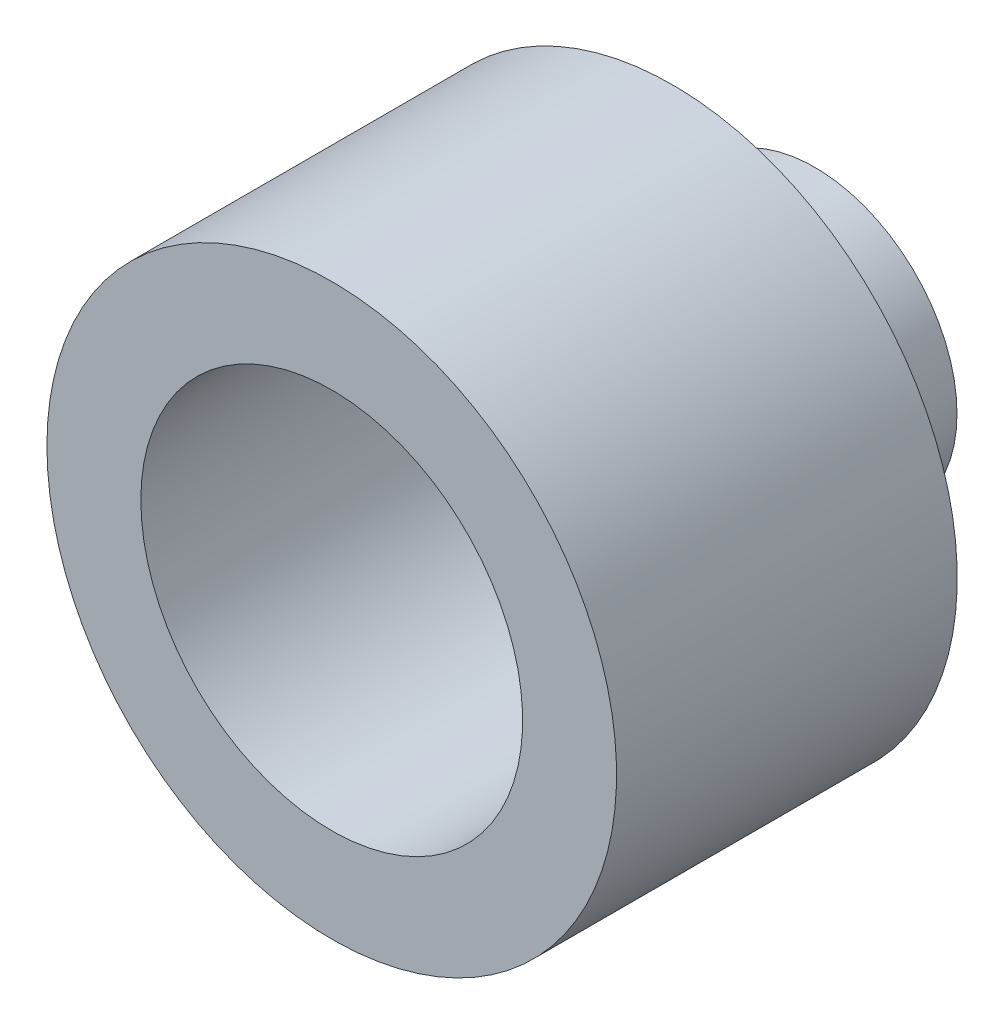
ISO-10303-21;
HEADER;
FILE_DESCRIPTION(('STEP AP214'),'2;1');
FILE_NAME('part.step','',(''),(''),'','','');
FILE_SCHEMA(('AUTOMOTIVE_DESIGN { 1 0 10303 214 1 1 1 1 }'));
ENDSEC;
DATA;
#1=APPLICATION_CONTEXT('core data for automotive mechanical design processes');
#2=APPLICATION_PROTOCOL_DEFINITION('international standard','automotive_design',2000,#1);
#3=PRODUCT_CONTEXT('',#1,'mechanical');
#4=PRODUCT('Part','Part','',(#3));
#5=PRODUCT_RELATED_PRODUCT_CATEGORY('part','',(#4));
#6=PRODUCT_DEFINITION_FORMATION('','',#4);
#7=PRODUCT_DEFINITION_CONTEXT('part definition',#1,'design');
#8=PRODUCT_DEFINITION('design','',#6,#7);
#9=PRODUCT_DEFINITION_SHAPE('','',#8);
#10=(LENGTH_UNIT() NAMED_UNIT(*) SI_UNIT(.MILLI.,.METRE.));
#11=(NAMED_UNIT(*) PLANE_ANGLE_UNIT() SI_UNIT($,.RADIAN.));
#12=(NAMED_UNIT(*) SI_UNIT($,.STERADIAN.) SOLID_ANGLE_UNIT());
#13=UNCERTAINTY_MEASURE_WITH_UNIT(LENGTH_MEASURE(1.E-05),#10,'distance_accuracy_value','');
#14=(GEOMETRIC_REPRESENTATION_CONTEXT(3) GLOBAL_UNCERTAINTY_ASSIGNED_CONTEXT((#13)) GLOBAL_UNIT_ASSIGNED_CONTEXT((#10,
#11,#12)) REPRESENTATION_CONTEXT('',''));
#15=CARTESIAN_POINT('',(0.,0.,0.));
#16=DIRECTION('',(0.,0.,1.));
#17=DIRECTION('',(1.,0.,0.));
#18=AXIS2_PLACEMENT_3D('',#15,#16,#17);
#19=CARTESIAN_POINT('',(0.,0.,0.));
#20=DIRECTION('',(0.,0.,-1.));
#21=DIRECTION('',(-1.,0.,0.));
#22=AXIS2_PLACEMENT_3D('',#19,#20,#21);
#23=CYLINDRICAL_SURFACE('',#22,26.035);
#24=CARTESIAN_POINT('',(0.,0.,0.));
#25=DIRECTION('',(0.,0.,-1.));
#26=DIRECTION('',(-1.,0.,0.));
#27=AXIS2_PLACEMENT_3D('',#24,#25,#26);
#28=CIRCLE('',#27,26.035);
#29=CARTESIAN_POINT('',(-26.035,0.,0.));
#30=VERTEX_POINT('',#29);
#31=EDGE_CURVE('E95',#30,#30,#28,.T.);
#32=ORIENTED_EDGE('',*,*,#31,.T.);
#33=EDGE_LOOP('',(#32));
#34=FACE_BOUND('',#33,.T.);
#35=CARTESIAN_POINT('',(0.,0.,-31.1404));
#36=DIRECTION('',(0.,0.,-1.));
#37=DIRECTION('',(-1.,0.,0.));
#38=AXIS2_PLACEMENT_3D('',#35,#36,#37);
#39=CIRCLE('',#38,26.035);
#40=CARTESIAN_POINT('',(-26.035,0.,-31.1404));
#41=VERTEX_POINT('',#40);
#42=EDGE_CURVE('E107',#41,#41,#39,.T.);
#43=ORIENTED_EDGE('',*,*,#42,.F.);
#44=EDGE_LOOP('',(#43));
#45=FACE_BOUND('',#44,.T.);
#46=ADVANCED_FACE('F38',(#34,#45),#23,.T.);
#47=CARTESIAN_POINT('',(0.,26.035,-31.1404));
#48=DIRECTION('',(0.,0.,-1.));
#49=DIRECTION('',(-1.,0.,0.));
#50=AXIS2_PLACEMENT_3D('',#47,#48,#49);
#51=PLANE('',#50);
#52=CARTESIAN_POINT('',(0.,0.,-31.1404));
#53=DIRECTION('',(0.,0.,-1.));
#54=DIRECTION('',(-1.,0.,0.));
#55=AXIS2_PLACEMENT_3D('',#52,#53,#54);
#56=CIRCLE('',#55,15.0048);
#57=CARTESIAN_POINT('',(-15.0048,0.,-31.1404));
#58=VERTEX_POINT('',#57);
#59=EDGE_CURVE('E54',#58,#58,#56,.F.);
#60=ORIENTED_EDGE('',*,*,#59,.T.);
#61=EDGE_LOOP('',(#60));
#62=FACE_BOUND('',#61,.T.);
#63=ORIENTED_EDGE('',*,*,#42,.T.);
#64=EDGE_LOOP('',(#63));
#65=FACE_BOUND('',#64,.T.);
#66=ADVANCED_FACE('F125',(#62,#65),#51,.T.);
#67=CARTESIAN_POINT('',(0.,0.,0.));
#68=DIRECTION('',(0.,0.,-1.));
#69=DIRECTION('',(-1.,0.,0.));
#70=AXIS2_PLACEMENT_3D('',#67,#68,#69);
#71=CYLINDRICAL_SURFACE('',#70,13.0048);
#72=CARTESIAN_POINT('',(0.,13.0048,-36.7648));
#73=CARTESIAN_POINT('',(0.117141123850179,13.0047980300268,-36.7648047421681));
#74=CARTESIAN_POINT('',(0.234347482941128,13.0032007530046,-36.7746345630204));
#75=CARTESIAN_POINT('',(0.465476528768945,12.9969826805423,-36.8136798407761));
#76=CARTESIAN_POINT('',(0.579396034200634,12.9923590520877,-36.8429134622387));
#77=CARTESIAN_POINT('',(0.80057366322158,12.9806071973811,-36.9198636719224));
#78=CARTESIAN_POINT('',(0.90783702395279,12.973480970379,-36.9675655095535));
#79=CARTESIAN_POINT('',(1.11282271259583,12.9575087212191,-37.0800602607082));
#80=CARTESIAN_POINT('',(1.2105462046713,12.9486629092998,-37.1448510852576));
#81=CARTESIAN_POINT('',(1.39457202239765,12.9301440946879,-37.2903051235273));
#82=CARTESIAN_POINT('',(1.48077605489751,12.9204650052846,-37.371091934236));
#83=CARTESIAN_POINT('',(1.63846719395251,12.9014174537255,-37.5459786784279));
#84=CARTESIAN_POINT('',(1.70995339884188,12.8920490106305,-37.6400794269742));
#85=CARTESIAN_POINT('',(1.83656998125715,12.8746245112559,-37.8395933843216));
#86=CARTESIAN_POINT('',(1.89160382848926,12.8665763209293,-37.9450686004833));
#87=CARTESIAN_POINT('',(1.98313632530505,12.8527876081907,-38.163917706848));
#88=CARTESIAN_POINT('',(2.01963614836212,12.8470469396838,-38.2772910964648));
#89=CARTESIAN_POINT('',(2.07275621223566,12.8385836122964,-38.5076789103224));
#90=CARTESIAN_POINT('',(2.08954570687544,12.8358352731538,-38.6246533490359));
#91=CARTESIAN_POINT('',(2.10329315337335,12.8335900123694,-38.859788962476));
#92=CARTESIAN_POINT('',(2.10025242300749,12.8340928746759,-38.9779500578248));
#93=CARTESIAN_POINT('',(2.07456374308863,12.8382697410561,-39.2109006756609));
#94=CARTESIAN_POINT('',(2.0521053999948,12.8419130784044,-39.3257117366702));
#95=CARTESIAN_POINT('',(1.98851632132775,12.8519124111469,-39.5499144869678));
#96=CARTESIAN_POINT('',(1.94738498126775,12.8582684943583,-39.6593060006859));
#97=CARTESIAN_POINT('',(1.84742364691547,12.8730105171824,-39.8701350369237));
#98=CARTESIAN_POINT('',(1.78851441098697,12.8814055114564,-39.9715343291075));
#99=CARTESIAN_POINT('',(1.65472581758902,12.8992730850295,-40.1630805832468));
#100=CARTESIAN_POINT('',(1.57984524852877,12.9087457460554,-40.2532266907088));
#101=CARTESIAN_POINT('',(1.41520401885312,12.9278363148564,-40.4208056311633));
#102=CARTESIAN_POINT('',(1.32528056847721,12.9374546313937,-40.498078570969));
#103=CARTESIAN_POINT('',(1.13365810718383,12.9556508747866,-40.6364620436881));
#104=CARTESIAN_POINT('',(1.03195902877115,12.9642287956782,-40.6975724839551));
#105=CARTESIAN_POINT('',(0.819525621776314,12.9793888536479,-40.8019087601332));
#106=CARTESIAN_POINT('',(0.708784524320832,12.9859694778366,-40.8451210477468));
#107=CARTESIAN_POINT('',(0.481486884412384,12.9963811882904,-40.9122890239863));
#108=CARTESIAN_POINT('',(0.364930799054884,13.0002124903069,-40.9362462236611));
#109=CARTESIAN_POINT('',(0.130690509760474,13.0046650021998,-40.9640085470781));
#110=CARTESIAN_POINT('',(0.0130329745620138,13.0053211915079,-40.968033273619));
#111=CARTESIAN_POINT('',(-0.221275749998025,13.0034451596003,-40.9564010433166));
#112=CARTESIAN_POINT('',(-0.337926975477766,13.0009130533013,-40.9407447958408));
#113=CARTESIAN_POINT('',(-0.566237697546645,12.992966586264,-40.8903776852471));
#114=CARTESIAN_POINT('',(-0.677921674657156,12.987568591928,-40.8557749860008));
#115=CARTESIAN_POINT('',(-0.893903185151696,12.9744933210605,-40.7686121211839));
#116=CARTESIAN_POINT('',(-0.998200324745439,12.9668159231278,-40.7160509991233));
#117=CARTESIAN_POINT('',(-1.19740522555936,12.949947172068,-40.5939564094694));
#118=CARTESIAN_POINT('',(-1.29222744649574,12.9407437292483,-40.5242850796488));
#119=CARTESIAN_POINT('',(-1.46891250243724,12.9218817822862,-40.3701381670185));
#120=CARTESIAN_POINT('',(-1.55077445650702,12.9122232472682,-40.2856615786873));
#121=CARTESIAN_POINT('',(-1.70002443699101,12.8934272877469,-40.103319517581));
#122=CARTESIAN_POINT('',(-1.76726445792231,12.8842958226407,-40.0053321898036));
#123=CARTESIAN_POINT('',(-1.88432978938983,12.8676973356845,-39.7993243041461));
#124=CARTESIAN_POINT('',(-1.93415562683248,12.8602302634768,-39.6913040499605));
#125=CARTESIAN_POINT('',(-2.01475426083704,12.8478502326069,-39.4687192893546));
#126=CARTESIAN_POINT('',(-2.04560208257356,12.8429272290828,-39.3541825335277));
#127=CARTESIAN_POINT('',(-2.08760602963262,12.8361670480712,-39.1214675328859));
#128=CARTESIAN_POINT('',(-2.09876375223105,12.8343296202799,-39.0032895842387));
#129=CARTESIAN_POINT('',(-2.10102832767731,12.8339589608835,-38.7681238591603));
#130=CARTESIAN_POINT('',(-2.09236805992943,12.8353873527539,-38.6511383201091));
#131=CARTESIAN_POINT('',(-2.05574459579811,12.8413035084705,-38.4203117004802));
#132=CARTESIAN_POINT('',(-2.02778145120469,12.8457912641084,-38.3064706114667));
#133=CARTESIAN_POINT('',(-1.95343303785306,12.8573062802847,-38.0852462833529));
#134=CARTESIAN_POINT('',(-1.90706660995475,12.8643309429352,-37.9778565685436));
#135=CARTESIAN_POINT('',(-1.79725145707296,12.8801309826,-37.7723425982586));
#136=CARTESIAN_POINT('',(-1.73380197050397,12.8889064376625,-37.6742187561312));
#137=CARTESIAN_POINT('',(-1.59078581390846,12.9073415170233,-37.4888431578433));
#138=CARTESIAN_POINT('',(-1.51104743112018,12.917009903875,-37.4017247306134));
#139=CARTESIAN_POINT('',(-1.33807948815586,12.9360705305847,-37.2420243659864));
#140=CARTESIAN_POINT('',(-1.24484681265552,12.9454627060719,-37.1694457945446));
#141=CARTESIAN_POINT('',(-1.04682470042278,12.9629825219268,-37.0404607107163));
#142=CARTESIAN_POINT('',(-0.941964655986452,12.971101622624,-36.9841614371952));
#143=CARTESIAN_POINT('',(-0.724189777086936,12.9850772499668,-36.8900618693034));
#144=CARTESIAN_POINT('',(-0.611283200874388,12.9909360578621,-36.8522429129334));
#145=CARTESIAN_POINT('',(-0.414929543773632,12.9984333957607,-36.804506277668));
#146=CARTESIAN_POINT('',(-0.332678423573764,13.0008082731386,-36.7896399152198));
#147=CARTESIAN_POINT('',(-0.166962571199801,13.0039922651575,-36.7697851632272));
#148=CARTESIAN_POINT('',(-0.0834978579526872,13.0048014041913,-36.7647966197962));
#149=CARTESIAN_POINT('',(0.,13.0048,-36.7648));
#150=B_SPLINE_CURVE_WITH_KNOTS('',3,(#72,#73,#74,#75,#76,#77,#78,#79,#80,#81,#82,#83,#84,#85,
#86,#87,#88,#89,#90,#91,#92,#93,#94,#95,#96,#97,#98,#99,#100,#101,#102,#103,#104,#105,#106,#107,
#108,#109,#110,#111,#112,#113,#114,#115,#116,#117,#118,#119,#120,#121,#122,#123,#124,#125,#126,
#127,#128,#129,#130,#131,#132,#133,#134,#135,#136,#137,#138,#139,#140,#141,#142,#143,#144,#145,
#146,#147,#148,#149),.UNSPECIFIED.,.T.,.F.,(4,2,2,2,2,2,2,2,2,2,2,2,2,2,2,2,2,2,2,2,2,2,2,2,2,2,
2,2,2,2,2,2,2,2,2,2,2,2,4),(0.,0.35111819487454,0.70256554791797,1.05373277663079,
1.40485709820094,1.75880851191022,2.11278160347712,2.46879252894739,2.82478091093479,
3.17768950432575,3.53057464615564,3.88005240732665,4.22954148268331,4.58061194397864,
4.93170904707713,5.28688573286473,5.64206445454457,5.99751154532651,6.35293073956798,
6.70442531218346,7.05590721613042,7.40540314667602,7.75491769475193,8.10734651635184,
8.45979928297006,8.815668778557,9.17152750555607,9.52597023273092,9.88038420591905,
10.2306549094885,10.580924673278,10.9308367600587,11.28076444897,11.6345913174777,
11.98850000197,12.3446895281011,12.7005186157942,12.9507985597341,13.2010746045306),.UNSPECIFIED.);
#151=CARTESIAN_POINT('',(0.,13.0048,-36.7648));
#152=VERTEX_POINT('',#151);
#153=EDGE_CURVE('E10',#152,#152,#150,.T.);
#154=ORIENTED_EDGE('',*,*,#153,.F.);
#155=EDGE_LOOP('',(#154));
#156=FACE_BOUND('',#155,.T.);
#157=CARTESIAN_POINT('',(-13.0048,0.,-33.7648));
#158=CARTESIAN_POINT('',(-13.0047980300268,0.117141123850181,-33.7648047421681));
#159=CARTESIAN_POINT('',(-13.0032007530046,0.234347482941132,-33.7746345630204));
#160=CARTESIAN_POINT('',(-12.9969826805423,0.465476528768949,-33.813679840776));
#161=CARTESIAN_POINT('',(-12.9923590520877,0.579396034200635,-33.8429134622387));
#162=CARTESIAN_POINT('',(-12.9806071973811,0.800573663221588,-33.9198636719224));
#163=CARTESIAN_POINT('',(-12.973480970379,0.907837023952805,-33.9675655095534));
#164=CARTESIAN_POINT('',(-12.9575087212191,1.11282271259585,-34.0800602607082));
#165=CARTESIAN_POINT('',(-12.9486629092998,1.21054620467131,-34.1448510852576));
#166=CARTESIAN_POINT('',(-12.9301440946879,1.39457202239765,-34.2903051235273));
#167=CARTESIAN_POINT('',(-12.9204650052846,1.48077605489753,-34.3710919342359));
#168=CARTESIAN_POINT('',(-12.9014174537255,1.63846719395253,-34.5459786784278));
#169=CARTESIAN_POINT('',(-12.8920490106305,1.70995339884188,-34.6400794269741));
#170=CARTESIAN_POINT('',(-12.8746245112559,1.83656998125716,-34.8395933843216));
#171=CARTESIAN_POINT('',(-12.8665763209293,1.89160382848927,-34.9450686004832));
#172=CARTESIAN_POINT('',(-12.8527876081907,1.98313632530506,-35.163917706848));
#173=CARTESIAN_POINT('',(-12.8470469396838,2.01963614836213,-35.2772910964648));
#174=CARTESIAN_POINT('',(-12.8385836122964,2.07275621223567,-35.5076789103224));
#175=CARTESIAN_POINT('',(-12.8358352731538,2.08954570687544,-35.6246533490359));
#176=CARTESIAN_POINT('',(-12.8335900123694,2.10329315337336,-35.859788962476));
#177=CARTESIAN_POINT('',(-12.8340928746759,2.1002524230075,-35.9779500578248));
#178=CARTESIAN_POINT('',(-12.8382697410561,2.07456374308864,-36.2109006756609));
#179=CARTESIAN_POINT('',(-12.8419130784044,2.0521053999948,-36.3257117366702));
#180=CARTESIAN_POINT('',(-12.8519124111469,1.98851632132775,-36.5499144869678));
#181=CARTESIAN_POINT('',(-12.8582684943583,1.94738498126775,-36.6593060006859));
#182=CARTESIAN_POINT('',(-12.8730105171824,1.84742364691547,-36.8701350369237));
#183=CARTESIAN_POINT('',(-12.8814055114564,1.78851441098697,-36.9715343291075));
#184=CARTESIAN_POINT('',(-12.8992730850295,1.65472581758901,-37.1630805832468));
#185=CARTESIAN_POINT('',(-12.9087457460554,1.57984524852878,-37.2532266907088));
#186=CARTESIAN_POINT('',(-12.9278363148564,1.41520401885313,-37.4208056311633));
#187=CARTESIAN_POINT('',(-12.9374546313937,1.3252805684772,-37.498078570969));
#188=CARTESIAN_POINT('',(-12.9556508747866,1.13365810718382,-37.636462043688));
#189=CARTESIAN_POINT('',(-12.9642287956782,1.03195902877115,-37.6975724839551));
#190=CARTESIAN_POINT('',(-12.9793888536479,0.819525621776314,-37.8019087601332));
#191=CARTESIAN_POINT('',(-12.9859694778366,0.708784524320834,-37.8451210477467));
#192=CARTESIAN_POINT('',(-12.9963811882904,0.481486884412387,-37.9122890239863));
#193=CARTESIAN_POINT('',(-13.0002124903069,0.364930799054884,-37.9362462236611));
#194=CARTESIAN_POINT('',(-13.0046650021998,0.130690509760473,-37.9640085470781));
#195=CARTESIAN_POINT('',(-13.0053211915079,0.0130329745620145,-37.968033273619));
#196=CARTESIAN_POINT('',(-13.0034451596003,-0.221275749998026,-37.9564010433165));
#197=CARTESIAN_POINT('',(-13.0009130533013,-0.337926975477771,-37.9407447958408));
#198=CARTESIAN_POINT('',(-12.992966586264,-0.566237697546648,-37.8903776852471));
#199=CARTESIAN_POINT('',(-12.987568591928,-0.677921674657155,-37.8557749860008));
#200=CARTESIAN_POINT('',(-12.9744933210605,-0.893903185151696,-37.7686121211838));
#201=CARTESIAN_POINT('',(-12.9668159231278,-0.998200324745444,-37.7160509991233));
#202=CARTESIAN_POINT('',(-12.949947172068,-1.19740522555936,-37.5939564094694));
#203=CARTESIAN_POINT('',(-12.9407437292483,-1.29222744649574,-37.5242850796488));
#204=CARTESIAN_POINT('',(-12.9218817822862,-1.46891250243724,-37.3701381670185));
#205=CARTESIAN_POINT('',(-12.9122232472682,-1.55077445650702,-37.2856615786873));
#206=CARTESIAN_POINT('',(-12.8934272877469,-1.70002443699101,-37.103319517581));
#207=CARTESIAN_POINT('',(-12.8842958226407,-1.76726445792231,-37.0053321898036));
#208=CARTESIAN_POINT('',(-12.8676973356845,-1.88432978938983,-36.799324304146));
#209=CARTESIAN_POINT('',(-12.8602302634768,-1.93415562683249,-36.6913040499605));
#210=CARTESIAN_POINT('',(-12.8478502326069,-2.01475426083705,-36.4687192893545));
#211=CARTESIAN_POINT('',(-12.8429272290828,-2.04560208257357,-36.3541825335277));
#212=CARTESIAN_POINT('',(-12.8361670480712,-2.08760602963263,-36.1214675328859));
#213=CARTESIAN_POINT('',(-12.8343296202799,-2.09876375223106,-36.0032895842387));
#214=CARTESIAN_POINT('',(-12.8339589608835,-2.10102832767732,-35.7681238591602));
#215=CARTESIAN_POINT('',(-12.8353873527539,-2.09236805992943,-35.651138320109));
#216=CARTESIAN_POINT('',(-12.8413035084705,-2.05574459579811,-35.4203117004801));
#217=CARTESIAN_POINT('',(-12.8457912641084,-2.0277814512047,-35.3064706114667));
#218=CARTESIAN_POINT('',(-12.8573062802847,-1.95343303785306,-35.0852462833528));
#219=CARTESIAN_POINT('',(-12.8643309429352,-1.90706660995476,-34.9778565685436));
#220=CARTESIAN_POINT('',(-12.8801309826,-1.79725145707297,-34.7723425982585));
#221=CARTESIAN_POINT('',(-12.8889064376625,-1.73380197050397,-34.6742187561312));
#222=CARTESIAN_POINT('',(-12.9073415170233,-1.59078581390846,-34.4888431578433));
#223=CARTESIAN_POINT('',(-12.917009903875,-1.51104743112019,-34.4017247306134));
#224=CARTESIAN_POINT('',(-12.9360705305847,-1.33807948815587,-34.2420243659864));
#225=CARTESIAN_POINT('',(-12.9454627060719,-1.24484681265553,-34.1694457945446));
#226=CARTESIAN_POINT('',(-12.9629825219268,-1.04682470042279,-34.0404607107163));
#227=CARTESIAN_POINT('',(-12.971101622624,-0.941964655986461,-33.9841614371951));
#228=CARTESIAN_POINT('',(-12.9850772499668,-0.724189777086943,-33.8900618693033));
#229=CARTESIAN_POINT('',(-12.9909360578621,-0.61128320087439,-33.8522429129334));
#230=CARTESIAN_POINT('',(-12.9984333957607,-0.41492954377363,-33.8045062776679));
#231=CARTESIAN_POINT('',(-13.0008082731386,-0.332678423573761,-33.7896399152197));
#232=CARTESIAN_POINT('',(-13.0039922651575,-0.1669625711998,-33.7697851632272));
#233=CARTESIAN_POINT('',(-13.0048014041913,-0.0834978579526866,-33.7647966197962));
#234=CARTESIAN_POINT('',(-13.0048,0.,-33.7648));
#235=B_SPLINE_CURVE_WITH_KNOTS('',3,(#157,#158,#159,#160,#161,#162,#163,#164,#165,#166,#167,
#168,#169,#170,#171,#172,#173,#174,#175,#176,#177,#178,#179,#180,#181,#182,#183,#184,#185,#186,
#187,#188,#189,#190,#191,#192,#193,#194,#195,#196,#197,#198,#199,#200,#201,#202,#203,#204,#205,
#206,#207,#208,#209,#210,#211,#212,#213,#214,#215,#216,#217,#218,#219,#220,#221,#222,#223,#224,
#225,#226,#227,#228,#229,#230,#231,#232,#233,#234),.UNSPECIFIED.,.T.,.F.,(4,2,2,2,2,2,2,2,2,2,2,
2,2,2,2,2,2,2,2,2,2,2,2,2,2,2,2,2,2,2,2,2,2,2,2,2,2,2,4),(0.,0.351118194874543,
0.702565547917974,1.05373277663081,1.40485709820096,1.75880851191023,2.11278160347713,
2.46879252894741,2.82478091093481,3.17768950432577,3.53057464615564,3.88005240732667,
4.22954148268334,4.58061194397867,4.93170904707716,5.28688573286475,5.64206445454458,
5.99751154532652,6.352930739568,6.70442531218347,7.05590721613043,7.40540314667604,
7.75491769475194,8.10734651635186,8.45979928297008,8.81566877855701,9.17152750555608,
9.52597023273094,9.88038420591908,10.2306549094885,10.580924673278,10.9308367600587,
11.28076444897,11.6345913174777,11.98850000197,12.3446895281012,12.7005186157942,
12.9507985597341,13.2010746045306),.UNSPECIFIED.);
#236=CARTESIAN_POINT('',(-13.0048,0.,-33.7648));
#237=VERTEX_POINT('',#236);
#238=EDGE_CURVE('E50',#237,#237,#235,.T.);
#239=ORIENTED_EDGE('',*,*,#238,.F.);
#240=EDGE_LOOP('',(#239));
#241=FACE_BOUND('',#240,.T.);
#242=CARTESIAN_POINT('',(0.,0.,-33.1404));
#243=DIRECTION('',(0.,0.,-1.));
#244=DIRECTION('',(-1.,0.,0.));
#245=AXIS2_PLACEMENT_3D('',#242,#243,#244);
#246=CIRCLE('',#245,13.0048);
#247=CARTESIAN_POINT('',(-13.0048,0.,-33.1404));
#248=VERTEX_POINT('',#247);
#249=EDGE_CURVE('E58',#248,#248,#246,.T.);
#250=ORIENTED_EDGE('',*,*,#249,.T.);
#251=EDGE_LOOP('',(#250));
#252=FACE_BOUND('',#251,.T.);
#253=CARTESIAN_POINT('',(0.,0.,-44.1452));
#254=DIRECTION('',(0.,0.,-1.));
#255=DIRECTION('',(-1.,0.,0.));
#256=AXIS2_PLACEMENT_3D('',#253,#254,#255);
#257=CIRCLE('',#256,13.0048);
#258=CARTESIAN_POINT('',(-13.0048,0.,-44.1452));
#259=VERTEX_POINT('',#258);
#260=EDGE_CURVE('E104',#259,#259,#257,.T.);
#261=ORIENTED_EDGE('',*,*,#260,.F.);
#262=EDGE_LOOP('',(#261));
#263=FACE_BOUND('',#262,.T.);
#264=ADVANCED_FACE('F65',(#156,#241,#252,#263),#71,.T.);
#265=CARTESIAN_POINT('',(0.,13.0048,-44.1452));
#266=DIRECTION('',(0.,0.,-1.));
#267=DIRECTION('',(-1.,0.,0.));
#268=AXIS2_PLACEMENT_3D('',#265,#266,#267);
#269=PLANE('',#268);
#270=CARTESIAN_POINT('',(0.,0.,-44.1452));
#271=DIRECTION('',(0.,0.,-1.));
#272=DIRECTION('',(-1.,0.,0.));
#273=AXIS2_PLACEMENT_3D('',#270,#271,#272);
#274=CIRCLE('',#273,3.50012);
#275=CARTESIAN_POINT('',(-3.50012,0.,-44.1452));
#276=VERTEX_POINT('',#275);
#277=EDGE_CURVE('E87',#276,#276,#274,.T.);
#278=ORIENTED_EDGE('',*,*,#277,.F.);
#279=EDGE_LOOP('',(#278));
#280=FACE_BOUND('',#279,.T.);
#281=ORIENTED_EDGE('',*,*,#260,.T.);
#282=EDGE_LOOP('',(#281));
#283=FACE_BOUND('',#282,.T.);
#284=ADVANCED_FACE('F147',(#280,#283),#269,.T.);
#285=CARTESIAN_POINT('',(0.,17.4498,-28.194));
#286=DIRECTION('',(0.,0.,1.));
#287=DIRECTION('',(1.,0.,0.));
#288=AXIS2_PLACEMENT_3D('',#285,#286,#287);
#289=PLANE('',#288);
#290=CARTESIAN_POINT('',(0.,0.,-28.194));
#291=DIRECTION('',(0.,0.,1.));
#292=DIRECTION('',(1.,0.,0.));
#293=AXIS2_PLACEMENT_3D('',#290,#291,#292);
#294=CIRCLE('',#293,3.50012);
#295=CARTESIAN_POINT('',(3.50012,0.,-28.194));
#296=VERTEX_POINT('',#295);
#297=EDGE_CURVE('E94',#296,#296,#294,.T.);
#298=ORIENTED_EDGE('',*,*,#297,.F.);
#299=EDGE_LOOP('',(#298));
#300=FACE_BOUND('',#299,.T.);
#301=CARTESIAN_POINT('',(0.,0.,-28.194));
#302=DIRECTION('',(0.,0.,-1.));
#303=DIRECTION('',(-1.,0.,0.));
#304=AXIS2_PLACEMENT_3D('',#301,#302,#303);
#305=CIRCLE('',#304,17.4498);
#306=CARTESIAN_POINT('',(-17.4498,0.,-28.194));
#307=VERTEX_POINT('',#306);
#308=EDGE_CURVE('E101',#307,#307,#305,.T.);
#309=ORIENTED_EDGE('',*,*,#308,.F.);
#310=EDGE_LOOP('',(#309));
#311=FACE_BOUND('',#310,.T.);
#312=ADVANCED_FACE('F142',(#300,#311),#289,.T.);
#313=CARTESIAN_POINT('',(0.,0.,0.));
#314=DIRECTION('',(0.,0.,-1.));
#315=DIRECTION('',(-1.,0.,0.));
#316=AXIS2_PLACEMENT_3D('',#313,#314,#315);
#317=CYLINDRICAL_SURFACE('',#316,17.4498);
#318=ORIENTED_EDGE('',*,*,#308,.T.);
#319=EDGE_LOOP('',(#318));
#320=FACE_BOUND('',#319,.T.);
#321=CARTESIAN_POINT('',(0.,0.,0.));
#322=DIRECTION('',(0.,0.,-1.));
#323=DIRECTION('',(-1.,0.,0.));
#324=AXIS2_PLACEMENT_3D('',#321,#322,#323);
#325=CIRCLE('',#324,17.4498);
#326=CARTESIAN_POINT('',(-17.4498,0.,0.));
#327=VERTEX_POINT('',#326);
#328=EDGE_CURVE('E98',#327,#327,#325,.T.);
#329=ORIENTED_EDGE('',*,*,#328,.F.);
#330=EDGE_LOOP('',(#329));
#331=FACE_BOUND('',#330,.T.);
#332=ADVANCED_FACE('F137',(#320,#331),#317,.F.);
#333=CARTESIAN_POINT('',(0.,26.035,0.));
#334=DIRECTION('',(0.,0.,1.));
#335=DIRECTION('',(1.,0.,0.));
#336=AXIS2_PLACEMENT_3D('',#333,#334,#335);
#337=PLANE('',#336);
#338=ORIENTED_EDGE('',*,*,#328,.T.);
#339=EDGE_LOOP('',(#338));
#340=FACE_BOUND('',#339,.T.);
#341=ORIENTED_EDGE('',*,*,#31,.F.);
#342=EDGE_LOOP('',(#341));
#343=FACE_BOUND('',#342,.T.);
#344=ADVANCED_FACE('F121',(#340,#343),#337,.T.);
#345=CARTESIAN_POINT('',(0.,0.,0.));
#346=DIRECTION('',(0.,0.,-1.));
#347=DIRECTION('',(-1.,0.,0.));
#348=AXIS2_PLACEMENT_3D('',#345,#346,#347);
#349=CYLINDRICAL_SURFACE('',#348,3.50012);
#350=CARTESIAN_POINT('',(0.,3.50012,-36.7648));
#351=CARTESIAN_POINT('',(0.107420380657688,3.50011395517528,-36.764806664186));
#352=CARTESIAN_POINT('',(0.21501593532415,3.49512056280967,-36.7731004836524));
#353=CARTESIAN_POINT('',(0.426968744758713,3.47561942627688,-36.8058542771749));
#354=CARTESIAN_POINT('',(0.531317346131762,3.46108821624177,-36.8303541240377));
#355=CARTESIAN_POINT('',(0.733256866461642,3.42398348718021,-36.8941425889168));
#356=CARTESIAN_POINT('',(0.830878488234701,3.40144986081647,-36.9333579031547));
#357=CARTESIAN_POINT('',(1.01784876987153,3.35025863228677,-37.0250078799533));
#358=CARTESIAN_POINT('',(1.10719947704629,3.32160255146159,-37.0774392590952));
#359=CARTESIAN_POINT('',(1.28282662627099,3.25800095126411,-37.1984906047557));
#360=CARTESIAN_POINT('',(1.36834552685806,3.22274205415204,-37.2680418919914));
#361=CARTESIAN_POINT('',(1.52724403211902,3.15055546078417,-37.4192627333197));
#362=CARTESIAN_POINT('',(1.60060782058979,3.11362566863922,-37.5009478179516));
#363=CARTESIAN_POINT('',(1.74223750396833,3.03688886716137,-37.6859040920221));
#364=CARTESIAN_POINT('',(1.80877553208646,2.99728423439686,-37.7905939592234));
#365=CARTESIAN_POINT('',(1.9230653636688,2.92527632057,-38.0119970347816));
#366=CARTESIAN_POINT('',(1.97084765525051,2.8928613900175,-38.1286903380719));
#367=CARTESIAN_POINT('',(2.03617193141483,2.84710982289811,-38.3420484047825));
#368=CARTESIAN_POINT('',(2.05822995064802,2.83105639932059,-38.4367454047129));
#369=CARTESIAN_POINT('',(2.08902852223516,2.80841229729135,-38.6293433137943));
#370=CARTESIAN_POINT('',(2.09778563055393,2.80180985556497,-38.7272400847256));
#371=CARTESIAN_POINT('',(2.10147656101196,2.79904339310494,-38.9236383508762));
#372=CARTESIAN_POINT('',(2.09638326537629,2.80289984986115,-39.0221406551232));
#373=CARTESIAN_POINT('',(2.07264055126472,2.8204977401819,-39.2166159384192));
#374=CARTESIAN_POINT('',(2.05398093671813,2.83424660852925,-39.3125869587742));
#375=CARTESIAN_POINT('',(2.00442579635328,2.86949737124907,-39.4983714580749));
#376=CARTESIAN_POINT('',(1.97369137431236,2.89089686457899,-39.5882484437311));
#377=CARTESIAN_POINT('',(1.90111532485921,2.9391317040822,-39.7618061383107));
#378=CARTESIAN_POINT('',(1.85926962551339,2.96596904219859,-39.8454845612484));
#379=CARTESIAN_POINT('',(1.75722853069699,3.02772683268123,-40.0198132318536));
#380=CARTESIAN_POINT('',(1.69510413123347,3.06324017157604,-40.1091249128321));
#381=CARTESIAN_POINT('',(1.55804347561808,3.13517823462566,-40.276982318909));
#382=CARTESIAN_POINT('',(1.48309497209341,3.1716038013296,-40.3555176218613));
#383=CARTESIAN_POINT('',(1.31009665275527,3.24724254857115,-40.5106899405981));
#384=CARTESIAN_POINT('',(1.21028306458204,3.28613690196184,-40.5855375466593));
#385=CARTESIAN_POINT('',(0.997141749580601,3.35695242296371,-40.7171949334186));
#386=CARTESIAN_POINT('',(0.883821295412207,3.38887731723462,-40.7740143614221));
#387=CARTESIAN_POINT('',(0.654029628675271,3.44035649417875,-40.8639203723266));
#388=CARTESIAN_POINT('',(0.538207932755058,3.46056401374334,-40.8982777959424));
#389=CARTESIAN_POINT('',(0.301021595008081,3.48918806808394,-40.9466221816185));
#390=CARTESIAN_POINT('',(0.17966378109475,3.4976187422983,-40.9606335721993));
#391=CARTESIAN_POINT('',(-0.0472436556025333,3.50138736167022,-40.9669100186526));
#392=CARTESIAN_POINT('',(-0.152702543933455,3.49834747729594,-40.9618692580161));
#393=CARTESIAN_POINT('',(-0.361003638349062,3.48301814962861,-40.9361964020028));
#394=CARTESIAN_POINT('',(-0.463845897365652,3.47072889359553,-40.9155646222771));
#395=CARTESIAN_POINT('',(-0.661646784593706,3.43844120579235,-40.8604253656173));
#396=CARTESIAN_POINT('',(-0.756736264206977,3.41863738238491,-40.8262672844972));
#397=CARTESIAN_POINT('',(-0.939814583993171,3.37290701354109,-40.7454304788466));
#398=CARTESIAN_POINT('',(-1.02780201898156,3.34697926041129,-40.6987492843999));
#399=CARTESIAN_POINT('',(-1.20405101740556,3.28794921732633,-40.5887908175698));
#400=CARTESIAN_POINT('',(-1.29139374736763,3.2543816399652,-40.5242941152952));
#401=CARTESIAN_POINT('',(-1.45467726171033,3.1847529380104,-40.3832130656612));
#402=CARTESIAN_POINT('',(-1.53060457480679,3.14868893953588,-40.3066146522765));
#403=CARTESIAN_POINT('',(-1.67908469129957,3.07235248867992,-40.1318768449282));
#404=CARTESIAN_POINT('',(-1.74990864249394,3.03214398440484,-40.032231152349));
#405=CARTESIAN_POINT('',(-1.873862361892,2.95715010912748,-39.8206407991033));
#406=CARTESIAN_POINT('',(-1.92701077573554,2.92235904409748,-39.7087092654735));
#407=CARTESIAN_POINT('',(-2.00401614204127,2.86992103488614,-39.4999966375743));
#408=CARTESIAN_POINT('',(-2.0317199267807,2.85019431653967,-39.4051630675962));
#409=CARTESIAN_POINT('',(-2.07360243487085,2.81987519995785,-39.2111885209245));
#410=CARTESIAN_POINT('',(-2.0877999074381,2.80927014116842,-39.1120537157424));
#411=CARTESIAN_POINT('',(-2.101879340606,2.79875517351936,-38.9118044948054));
#412=CARTESIAN_POINT('',(-2.10170749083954,2.79888546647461,-38.8106840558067));
#413=CARTESIAN_POINT('',(-2.08692249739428,2.80992357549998,-38.6100813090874));
#414=CARTESIAN_POINT('',(-2.07230149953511,2.82083725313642,-38.5105999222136));
#415=CARTESIAN_POINT('',(-2.0305448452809,2.85102447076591,-38.3208502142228));
#416=CARTESIAN_POINT('',(-2.00404572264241,2.86987014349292,-38.2303689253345));
#417=CARTESIAN_POINT('',(-1.93985676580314,2.91364031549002,-38.0550589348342));
#418=CARTESIAN_POINT('',(-1.90216271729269,2.93856710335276,-37.9702323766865));
#419=CARTESIAN_POINT('',(-1.81000766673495,2.99634726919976,-37.7946815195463));
#420=CARTESIAN_POINT('',(-1.75386090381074,3.02983005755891,-37.7050513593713));
#421=CARTESIAN_POINT('',(-1.62920279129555,3.09864773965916,-37.5355970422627));
#422=CARTESIAN_POINT('',(-1.56068126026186,3.13398414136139,-37.4557810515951));
#423=CARTESIAN_POINT('',(-1.40006007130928,3.20932293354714,-37.2948424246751));
#424=CARTESIAN_POINT('',(-1.30593743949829,3.24914541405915,-37.2156332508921));
#425=CARTESIAN_POINT('',(-1.10377171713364,3.32327132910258,-37.07401009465));
#426=CARTESIAN_POINT('',(-0.99572365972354,3.35757278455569,-37.0116021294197));
#427=CARTESIAN_POINT('',(-0.771437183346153,3.41594328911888,-36.9078586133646));
#428=CARTESIAN_POINT('',(-0.655550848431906,3.44029348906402,-36.8659363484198));
#429=CARTESIAN_POINT('',(-0.47658948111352,3.46805015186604,-36.8186617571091));
#430=CARTESIAN_POINT('',(-0.416146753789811,3.47583732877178,-36.8055106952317));
#431=CARTESIAN_POINT('',(-0.294039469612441,3.48828469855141,-36.7845681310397));
#432=CARTESIAN_POINT('',(-0.23237597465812,3.4929474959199,-36.7767721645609));
#433=CARTESIAN_POINT('',(-0.142109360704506,3.49734920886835,-36.7694207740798));
#434=CARTESIAN_POINT('',(-0.11372670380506,3.49838700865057,-36.7676893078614));
#435=CARTESIAN_POINT('',(-0.0569001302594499,3.49977321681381,-36.7653780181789));
#436=CARTESIAN_POINT('',(-0.028456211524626,3.50012160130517,-36.7647982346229));
#437=CARTESIAN_POINT('',(0.,3.50012,-36.7648));
#438=B_SPLINE_CURVE_WITH_KNOTS('',3,(#350,#351,#352,#353,#354,#355,#356,#357,#358,#359,#360,
#361,#362,#363,#364,#365,#366,#367,#368,#369,#370,#371,#372,#373,#374,#375,#376,#377,#378,#379,
#380,#381,#382,#383,#384,#385,#386,#387,#388,#389,#390,#391,#392,#393,#394,#395,#396,#397,#398,
#399,#400,#401,#402,#403,#404,#405,#406,#407,#408,#409,#410,#411,#412,#413,#414,#415,#416,#417,
#418,#419,#420,#421,#422,#423,#424,#425,#426,#427,#428,#429,#430,#431,#432,#433,#434,#435,#436,
#437),.UNSPECIFIED.,.T.,.F.,(4,2,2,2,2,2,2,2,2,2,2,2,2,2,2,2,2,2,2,2,2,2,2,2,2,2,2,2,2,2,2,2,2,
2,2,2,2,2,2,2,2,2,2,4),(0.,0.322144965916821,0.645085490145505,0.966438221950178,
1.28771119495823,1.63355114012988,1.97983761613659,2.36858108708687,2.75668999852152,
3.05108300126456,3.34510926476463,3.63971161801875,3.93453561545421,4.22555278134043,
4.5166767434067,4.85869497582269,5.20104168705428,5.59109227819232,5.98093379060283,
6.34618734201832,6.71100198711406,7.02628651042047,7.34156465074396,7.64918082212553,
7.9568577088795,8.29645901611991,8.63645799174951,9.02075960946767,9.40465453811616,
9.7056542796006,10.0062355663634,10.3079425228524,10.6098135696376,10.897148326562,
11.1845913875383,11.5161674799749,11.8480176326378,12.2340373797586,12.620195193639,
12.9945290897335,13.1813028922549,13.3679208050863,13.4532557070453,13.5385935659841),.UNSPECIFIED.);
#439=CARTESIAN_POINT('',(0.,3.50012,-36.7648));
#440=VERTEX_POINT('',#439);
#441=EDGE_CURVE('E88',#440,#440,#438,.T.);
#442=ORIENTED_EDGE('',*,*,#441,.T.);
#443=EDGE_LOOP('',(#442));
#444=FACE_BOUND('',#443,.T.);
#445=CARTESIAN_POINT('',(-3.50012,0.,-33.7648));
#446=CARTESIAN_POINT('',(-3.50011395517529,0.107420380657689,-33.764806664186));
#447=CARTESIAN_POINT('',(-3.49512056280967,0.215015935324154,-33.7731004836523));
#448=CARTESIAN_POINT('',(-3.47561942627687,0.426968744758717,-33.8058542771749));
#449=CARTESIAN_POINT('',(-3.46108821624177,0.531317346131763,-33.8303541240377));
#450=CARTESIAN_POINT('',(-3.42398348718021,0.733256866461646,-33.8941425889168));
#451=CARTESIAN_POINT('',(-3.40144986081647,0.830878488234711,-33.9333579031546));
#452=CARTESIAN_POINT('',(-3.35025863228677,1.01784876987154,-34.0250078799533));
#453=CARTESIAN_POINT('',(-3.32160255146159,1.10719947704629,-34.0774392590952));
#454=CARTESIAN_POINT('',(-3.25800095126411,1.282826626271,-34.1984906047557));
#455=CARTESIAN_POINT('',(-3.22274205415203,1.36834552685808,-34.2680418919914));
#456=CARTESIAN_POINT('',(-3.15055546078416,1.52724403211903,-34.4192627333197));
#457=CARTESIAN_POINT('',(-3.11362566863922,1.6006078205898,-34.5009478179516));
#458=CARTESIAN_POINT('',(-3.03688886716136,1.74223750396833,-34.6859040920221));
#459=CARTESIAN_POINT('',(-2.99728423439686,1.80877553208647,-34.7905939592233));
#460=CARTESIAN_POINT('',(-2.92527632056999,1.92306536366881,-35.0119970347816));
#461=CARTESIAN_POINT('',(-2.89286139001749,1.97084765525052,-35.1286903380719));
#462=CARTESIAN_POINT('',(-2.84710982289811,2.03617193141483,-35.3420484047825));
#463=CARTESIAN_POINT('',(-2.83105639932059,2.05822995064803,-35.4367454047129));
#464=CARTESIAN_POINT('',(-2.80841229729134,2.08902852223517,-35.6293433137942));
#465=CARTESIAN_POINT('',(-2.80180985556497,2.09778563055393,-35.7272400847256));
#466=CARTESIAN_POINT('',(-2.79904339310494,2.10147656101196,-35.9236383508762));
#467=CARTESIAN_POINT('',(-2.80289984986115,2.09638326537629,-36.0221406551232));
#468=CARTESIAN_POINT('',(-2.82049774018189,2.07264055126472,-36.2166159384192));
#469=CARTESIAN_POINT('',(-2.83424660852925,2.05398093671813,-36.3125869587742));
#470=CARTESIAN_POINT('',(-2.86949737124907,2.00442579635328,-36.4983714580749));
#471=CARTESIAN_POINT('',(-2.890896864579,1.97369137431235,-36.5882484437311));
#472=CARTESIAN_POINT('',(-2.93913170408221,1.9011153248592,-36.7618061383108));
#473=CARTESIAN_POINT('',(-2.9659690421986,1.85926962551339,-36.8454845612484));
#474=CARTESIAN_POINT('',(-3.02772683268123,1.75722853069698,-37.0198132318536));
#475=CARTESIAN_POINT('',(-3.06324017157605,1.69510413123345,-37.1091249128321));
#476=CARTESIAN_POINT('',(-3.13517823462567,1.55804347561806,-37.276982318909));
#477=CARTESIAN_POINT('',(-3.17160380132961,1.4830949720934,-37.3555176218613));
#478=CARTESIAN_POINT('',(-3.24724254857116,1.31009665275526,-37.5106899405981));
#479=CARTESIAN_POINT('',(-3.28613690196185,1.21028306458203,-37.5855375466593));
#480=CARTESIAN_POINT('',(-3.35695242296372,0.997141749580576,-37.7171949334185));
#481=CARTESIAN_POINT('',(-3.38887731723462,0.883821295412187,-37.7740143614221));
#482=CARTESIAN_POINT('',(-3.44035649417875,0.654029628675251,-37.8639203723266));
#483=CARTESIAN_POINT('',(-3.46056401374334,0.538207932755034,-37.8982777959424));
#484=CARTESIAN_POINT('',(-3.48918806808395,0.301021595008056,-37.9466221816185));
#485=CARTESIAN_POINT('',(-3.4976187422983,0.179663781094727,-37.9606335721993));
#486=CARTESIAN_POINT('',(-3.50138736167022,-0.0472436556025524,-37.9669100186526));
#487=CARTESIAN_POINT('',(-3.49834747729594,-0.152702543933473,-37.961869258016));
#488=CARTESIAN_POINT('',(-3.48301814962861,-0.361003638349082,-37.9361964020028));
#489=CARTESIAN_POINT('',(-3.47072889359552,-0.463845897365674,-37.9155646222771));
#490=CARTESIAN_POINT('',(-3.43844120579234,-0.661646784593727,-37.8604253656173));
#491=CARTESIAN_POINT('',(-3.41863738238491,-0.756736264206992,-37.8262672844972));
#492=CARTESIAN_POINT('',(-3.37290701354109,-0.939814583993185,-37.7454304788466));
#493=CARTESIAN_POINT('',(-3.34697926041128,-1.02780201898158,-37.6987492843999));
#494=CARTESIAN_POINT('',(-3.28794921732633,-1.20405101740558,-37.5887908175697));
#495=CARTESIAN_POINT('',(-3.25438163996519,-1.29139374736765,-37.5242941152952));
#496=CARTESIAN_POINT('',(-3.18475293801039,-1.45467726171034,-37.3832130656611));
#497=CARTESIAN_POINT('',(-3.14868893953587,-1.53060457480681,-37.3066146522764));
#498=CARTESIAN_POINT('',(-3.07235248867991,-1.67908469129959,-37.1318768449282));
#499=CARTESIAN_POINT('',(-3.03214398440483,-1.74990864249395,-37.032231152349));
#500=CARTESIAN_POINT('',(-2.95715010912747,-1.87386236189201,-36.8206407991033));
#501=CARTESIAN_POINT('',(-2.92235904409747,-1.92701077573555,-36.7087092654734));
#502=CARTESIAN_POINT('',(-2.86992103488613,-2.00401614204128,-36.4999966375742));
#503=CARTESIAN_POINT('',(-2.85019431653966,-2.0317199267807,-36.4051630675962));
#504=CARTESIAN_POINT('',(-2.81987519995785,-2.07360243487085,-36.2111885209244));
#505=CARTESIAN_POINT('',(-2.80927014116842,-2.08779990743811,-36.1120537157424));
#506=CARTESIAN_POINT('',(-2.79875517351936,-2.10187934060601,-35.9118044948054));
#507=CARTESIAN_POINT('',(-2.7988854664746,-2.10170749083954,-35.8106840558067));
#508=CARTESIAN_POINT('',(-2.80992357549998,-2.08692249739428,-35.6100813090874));
#509=CARTESIAN_POINT('',(-2.82083725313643,-2.07230149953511,-35.5105999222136));
#510=CARTESIAN_POINT('',(-2.85102447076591,-2.0305448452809,-35.3208502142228));
#511=CARTESIAN_POINT('',(-2.86987014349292,-2.00404572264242,-35.2303689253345));
#512=CARTESIAN_POINT('',(-2.91364031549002,-1.93985676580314,-35.0550589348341));
#513=CARTESIAN_POINT('',(-2.93856710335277,-1.90216271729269,-34.9702323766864));
#514=CARTESIAN_POINT('',(-2.99634726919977,-1.81000766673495,-34.7946815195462));
#515=CARTESIAN_POINT('',(-3.02983005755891,-1.75386090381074,-34.7050513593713));
#516=CARTESIAN_POINT('',(-3.09864773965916,-1.62920279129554,-34.5355970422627));
#517=CARTESIAN_POINT('',(-3.13398414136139,-1.56068126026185,-34.4557810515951));
#518=CARTESIAN_POINT('',(-3.20932293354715,-1.40006007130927,-34.294842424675));
#519=CARTESIAN_POINT('',(-3.24914541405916,-1.30593743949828,-34.2156332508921));
#520=CARTESIAN_POINT('',(-3.32327132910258,-1.10377171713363,-34.07401009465));
#521=CARTESIAN_POINT('',(-3.35757278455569,-0.995723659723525,-34.0116021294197));
#522=CARTESIAN_POINT('',(-3.41594328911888,-0.771437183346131,-33.9078586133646));
#523=CARTESIAN_POINT('',(-3.44029348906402,-0.655550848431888,-33.8659363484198));
#524=CARTESIAN_POINT('',(-3.46805015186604,-0.476589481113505,-33.8186617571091));
#525=CARTESIAN_POINT('',(-3.47583732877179,-0.416146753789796,-33.8055106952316));
#526=CARTESIAN_POINT('',(-3.48828469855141,-0.294039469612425,-33.7845681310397));
#527=CARTESIAN_POINT('',(-3.4929474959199,-0.232375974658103,-33.7767721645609));
#528=CARTESIAN_POINT('',(-3.49734920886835,-0.142109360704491,-33.7694207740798));
#529=CARTESIAN_POINT('',(-3.49838700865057,-0.113726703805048,-33.7676893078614));
#530=CARTESIAN_POINT('',(-3.49977321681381,-0.0569001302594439,-33.7653780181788));
#531=CARTESIAN_POINT('',(-3.50012160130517,-0.0284562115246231,-33.7647982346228));
#532=CARTESIAN_POINT('',(-3.50012,0.,-33.7648));
#533=B_SPLINE_CURVE_WITH_KNOTS('',3,(#445,#446,#447,#448,#449,#450,#451,#452,#453,#454,#455,
#456,#457,#458,#459,#460,#461,#462,#463,#464,#465,#466,#467,#468,#469,#470,#471,#472,#473,#474,
#475,#476,#477,#478,#479,#480,#481,#482,#483,#484,#485,#486,#487,#488,#489,#490,#491,#492,#493,
#494,#495,#496,#497,#498,#499,#500,#501,#502,#503,#504,#505,#506,#507,#508,#509,#510,#511,#512,
#513,#514,#515,#516,#517,#518,#519,#520,#521,#522,#523,#524,#525,#526,#527,#528,#529,#530,#531,
#532),.UNSPECIFIED.,.T.,.F.,(4,2,2,2,2,2,2,2,2,2,2,2,2,2,2,2,2,2,2,2,2,2,2,2,2,2,2,2,2,2,2,2,2,
2,2,2,2,2,2,2,2,2,2,4),(0.,0.322144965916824,0.645085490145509,0.966438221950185,
1.28771119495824,1.63355114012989,1.9798376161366,2.36858108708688,2.75668999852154,
3.05108300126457,3.34510926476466,3.63971161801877,3.93453561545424,4.22555278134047,
4.51667674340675,4.85869497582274,5.20104168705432,5.59109227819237,5.98093379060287,
6.34618734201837,6.7110019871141,7.02628651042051,7.341564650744,7.64918082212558,
7.95685770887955,8.29645901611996,8.63645799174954,9.02075960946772,9.40465453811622,
9.70565427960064,10.0062355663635,10.3079425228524,10.6098135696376,10.8971483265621,
11.1845913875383,11.5161674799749,11.8480176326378,12.2340373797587,12.620195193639,
12.9945290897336,13.181302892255,13.3679208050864,13.4532557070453,13.5385935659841),.UNSPECIFIED.);
#534=CARTESIAN_POINT('',(-3.50012,0.,-33.7648));
#535=VERTEX_POINT('',#534);
#536=EDGE_CURVE('E80',#535,#535,#533,.T.);
#537=ORIENTED_EDGE('',*,*,#536,.T.);
#538=EDGE_LOOP('',(#537));
#539=FACE_BOUND('',#538,.T.);
#540=ORIENTED_EDGE('',*,*,#297,.T.);
#541=EDGE_LOOP('',(#540));
#542=FACE_BOUND('',#541,.T.);
#543=ORIENTED_EDGE('',*,*,#277,.T.);
#544=EDGE_LOOP('',(#543));
#545=FACE_BOUND('',#544,.T.);
#546=ADVANCED_FACE('F75',(#444,#539,#542,#545),#349,.F.);
#547=CARTESIAN_POINT('',(0.,0.,-33.1404));
#548=DIRECTION('',(0.,0.,-1.));
#549=DIRECTION('',(-1.,0.,0.));
#550=AXIS2_PLACEMENT_3D('',#547,#548,#549);
#551=TOROIDAL_SURFACE('',#550,15.0048,2.);
#552=ORIENTED_EDGE('',*,*,#59,.F.);
#553=EDGE_LOOP('',(#552));
#554=FACE_BOUND('',#553,.T.);
#555=ORIENTED_EDGE('',*,*,#249,.F.);
#556=EDGE_LOOP('',(#555));
#557=FACE_BOUND('',#556,.T.);
#558=ADVANCED_FACE('F40',(#554,#557),#551,.F.);
#559=CARTESIAN_POINT('',(-13.0048,0.,-35.8648));
#560=DIRECTION('',(-1.,0.,0.));
#561=DIRECTION('',(0.,0.,1.));
#562=AXIS2_PLACEMENT_3D('',#559,#560,#561);
#563=CYLINDRICAL_SURFACE('',#562,2.1);
#564=ORIENTED_EDGE('',*,*,#238,.T.);
#565=EDGE_LOOP('',(#564));
#566=FACE_BOUND('',#565,.T.);
#567=ORIENTED_EDGE('',*,*,#536,.F.);
#568=EDGE_LOOP('',(#567));
#569=FACE_BOUND('',#568,.T.);
#570=ADVANCED_FACE('F69',(#566,#569),#563,.F.);
#571=CARTESIAN_POINT('',(0.,13.0048,-38.8648));
#572=DIRECTION('',(0.,1.,0.));
#573=DIRECTION('',(0.,0.,1.));
#574=AXIS2_PLACEMENT_3D('',#571,#572,#573);
#575=CYLINDRICAL_SURFACE('',#574,2.09999999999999);
#576=ORIENTED_EDGE('',*,*,#153,.T.);
#577=EDGE_LOOP('',(#576));
#578=FACE_BOUND('',#577,.T.);
#579=ORIENTED_EDGE('',*,*,#441,.F.);
#580=EDGE_LOOP('',(#579));
#581=FACE_BOUND('',#580,.T.);
#582=ADVANCED_FACE('F73',(#578,#581),#575,.F.);
#583=CLOSED_SHELL('',(#46,#66,#264,#284,#312,#332,#344,#546,#558,#570,#582));
#584=MANIFOLD_SOLID_BREP('B2',#583);
#585=ADVANCED_BREP_SHAPE_REPRESENTATION('',(#18,#584),#14);
#586=SHAPE_DEFINITION_REPRESENTATION(#9,#585);
ENDSEC;
END-ISO-10303-21;
